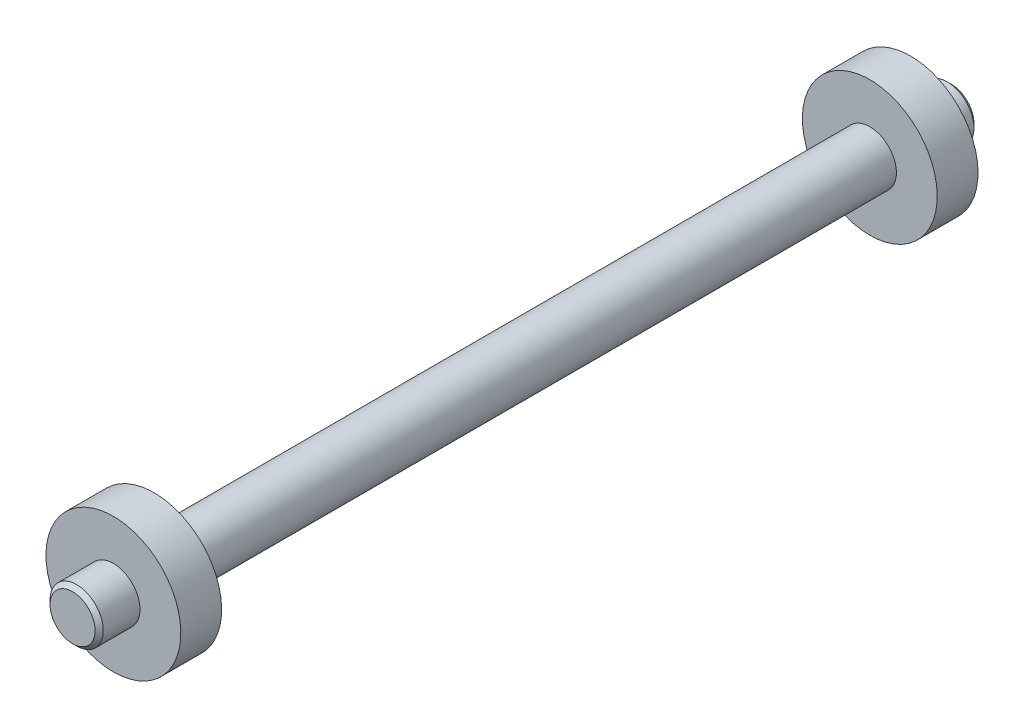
ISO-10303-21;
HEADER;
FILE_DESCRIPTION(('STEP AP214'),'2;1');
FILE_NAME('part.step','',(''),(''),'','','');
FILE_SCHEMA(('AUTOMOTIVE_DESIGN { 1 0 10303 214 1 1 1 1 }'));
ENDSEC;
DATA;
#1=APPLICATION_CONTEXT('core data for automotive mechanical design processes');
#2=APPLICATION_PROTOCOL_DEFINITION('international standard','automotive_design',2000,#1);
#3=PRODUCT_CONTEXT('',#1,'mechanical');
#4=PRODUCT('Part','Part','',(#3));
#5=PRODUCT_RELATED_PRODUCT_CATEGORY('part','',(#4));
#6=PRODUCT_DEFINITION_FORMATION('','',#4);
#7=PRODUCT_DEFINITION_CONTEXT('part definition',#1,'design');
#8=PRODUCT_DEFINITION('design','',#6,#7);
#9=PRODUCT_DEFINITION_SHAPE('','',#8);
#10=(LENGTH_UNIT() NAMED_UNIT(*) SI_UNIT(.MILLI.,.METRE.));
#11=(NAMED_UNIT(*) PLANE_ANGLE_UNIT() SI_UNIT($,.RADIAN.));
#12=(NAMED_UNIT(*) SI_UNIT($,.STERADIAN.) SOLID_ANGLE_UNIT());
#13=UNCERTAINTY_MEASURE_WITH_UNIT(LENGTH_MEASURE(1.E-05),#10,'distance_accuracy_value','');
#14=(GEOMETRIC_REPRESENTATION_CONTEXT(3) GLOBAL_UNCERTAINTY_ASSIGNED_CONTEXT((#13)) GLOBAL_UNIT_ASSIGNED_CONTEXT((#10,
#11,#12)) REPRESENTATION_CONTEXT('',''));
#15=CARTESIAN_POINT('',(0.,0.,0.));
#16=DIRECTION('',(0.,0.,1.));
#17=DIRECTION('',(1.,0.,0.));
#18=AXIS2_PLACEMENT_3D('',#15,#16,#17);
#19=CARTESIAN_POINT('',(0.,1.06,17.5));
#20=DIRECTION('',(0.,0.,-1.));
#21=DIRECTION('',(0.,1.,0.));
#22=AXIS2_PLACEMENT_3D('',#19,#20,#21);
#23=PLANE('',#22);
#24=CARTESIAN_POINT('',(0.,0.,17.5));
#25=DIRECTION('',(0.,0.,-1.));
#26=DIRECTION('',(0.,1.,0.));
#27=AXIS2_PLACEMENT_3D('',#24,#25,#26);
#28=CIRCLE('',#27,0.897500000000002);
#29=CARTESIAN_POINT('',(-0.897500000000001,0.,17.5));
#30=VERTEX_POINT('',#29);
#31=EDGE_CURVE('E35',#30,#30,#28,.F.);
#32=ORIENTED_EDGE('',*,*,#31,.T.);
#33=EDGE_LOOP('',(#32));
#34=FACE_BOUND('',#33,.T.);
#35=ADVANCED_FACE('F28',(#34),#23,.F.);
#36=CARTESIAN_POINT('',(0.,0.,17.5));
#37=DIRECTION('',(0.,0.,1.));
#38=DIRECTION('',(0.,-1.,0.));
#39=AXIS2_PLACEMENT_3D('',#36,#37,#38);
#40=CYLINDRICAL_SURFACE('',#39,1.06);
#41=CARTESIAN_POINT('',(0.,0.,17.3375));
#42=DIRECTION('',(0.,0.,-1.));
#43=DIRECTION('',(-1.,0.,0.));
#44=AXIS2_PLACEMENT_3D('',#41,#42,#43);
#45=CIRCLE('',#44,1.06);
#46=CARTESIAN_POINT('',(-1.06,0.,17.3375));
#47=VERTEX_POINT('',#46);
#48=EDGE_CURVE('E10',#47,#47,#45,.T.);
#49=ORIENTED_EDGE('',*,*,#48,.T.);
#50=EDGE_LOOP('',(#49));
#51=FACE_BOUND('',#50,.T.);
#52=CARTESIAN_POINT('',(0.,0.,15.875));
#53=DIRECTION('',(0.,0.,1.));
#54=DIRECTION('',(0.,-1.,0.));
#55=AXIS2_PLACEMENT_3D('',#52,#53,#54);
#56=CIRCLE('',#55,1.06);
#57=CARTESIAN_POINT('',(0.,-1.06,15.875));
#58=VERTEX_POINT('',#57);
#59=EDGE_CURVE('E48',#58,#58,#56,.T.);
#60=ORIENTED_EDGE('',*,*,#59,.T.);
#61=EDGE_LOOP('',(#60));
#62=FACE_BOUND('',#61,.T.);
#63=ADVANCED_FACE('F91',(#51,#62),#40,.T.);
#64=CARTESIAN_POINT('',(0.,2.685,15.875));
#65=DIRECTION('',(0.,0.,-1.));
#66=DIRECTION('',(0.,1.,0.));
#67=AXIS2_PLACEMENT_3D('',#64,#65,#66);
#68=PLANE('',#67);
#69=ORIENTED_EDGE('',*,*,#59,.F.);
#70=EDGE_LOOP('',(#69));
#71=FACE_BOUND('',#70,.T.);
#72=CARTESIAN_POINT('',(0.,0.,15.875));
#73=DIRECTION('',(0.,0.,1.));
#74=DIRECTION('',(0.,-1.,0.));
#75=AXIS2_PLACEMENT_3D('',#72,#73,#74);
#76=CIRCLE('',#75,2.685);
#77=CARTESIAN_POINT('',(0.,-2.685,15.875));
#78=VERTEX_POINT('',#77);
#79=EDGE_CURVE('E51',#78,#78,#76,.T.);
#80=ORIENTED_EDGE('',*,*,#79,.T.);
#81=EDGE_LOOP('',(#80));
#82=FACE_BOUND('',#81,.T.);
#83=ADVANCED_FACE('F96',(#71,#82),#68,.F.);
#84=CARTESIAN_POINT('',(0.,0.,17.5));
#85=DIRECTION('',(0.,0.,1.));
#86=DIRECTION('',(0.,-1.,0.));
#87=AXIS2_PLACEMENT_3D('',#84,#85,#86);
#88=CYLINDRICAL_SURFACE('',#87,2.685);
#89=ORIENTED_EDGE('',*,*,#79,.F.);
#90=EDGE_LOOP('',(#89));
#91=FACE_BOUND('',#90,.T.);
#92=CARTESIAN_POINT('',(0.,0.,14.25));
#93=DIRECTION('',(0.,0.,1.));
#94=DIRECTION('',(0.,-1.,0.));
#95=AXIS2_PLACEMENT_3D('',#92,#93,#94);
#96=CIRCLE('',#95,2.685);
#97=CARTESIAN_POINT('',(0.,-2.685,14.25));
#98=VERTEX_POINT('',#97);
#99=EDGE_CURVE('E54',#98,#98,#96,.T.);
#100=ORIENTED_EDGE('',*,*,#99,.T.);
#101=EDGE_LOOP('',(#100));
#102=FACE_BOUND('',#101,.T.);
#103=ADVANCED_FACE('F182',(#91,#102),#88,.T.);
#104=CARTESIAN_POINT('',(0.,1.06,14.25));
#105=DIRECTION('',(0.,0.,1.));
#106=DIRECTION('',(0.,-1.,0.));
#107=AXIS2_PLACEMENT_3D('',#104,#105,#106);
#108=PLANE('',#107);
#109=ORIENTED_EDGE('',*,*,#99,.F.);
#110=EDGE_LOOP('',(#109));
#111=FACE_BOUND('',#110,.T.);
#112=CARTESIAN_POINT('',(0.,0.,14.25));
#113=DIRECTION('',(0.,0.,1.));
#114=DIRECTION('',(0.,-1.,0.));
#115=AXIS2_PLACEMENT_3D('',#112,#113,#114);
#116=CIRCLE('',#115,1.06);
#117=CARTESIAN_POINT('',(0.,-1.06,14.25));
#118=VERTEX_POINT('',#117);
#119=EDGE_CURVE('E57',#118,#118,#116,.T.);
#120=ORIENTED_EDGE('',*,*,#119,.T.);
#121=EDGE_LOOP('',(#120));
#122=FACE_BOUND('',#121,.T.);
#123=ADVANCED_FACE('F172',(#111,#122),#108,.F.);
#124=CARTESIAN_POINT('',(0.,0.,17.5));
#125=DIRECTION('',(0.,0.,1.));
#126=DIRECTION('',(0.,-1.,0.));
#127=AXIS2_PLACEMENT_3D('',#124,#125,#126);
#128=CYLINDRICAL_SURFACE('',#127,1.06);
#129=ORIENTED_EDGE('',*,*,#119,.F.);
#130=EDGE_LOOP('',(#129));
#131=FACE_BOUND('',#130,.T.);
#132=CARTESIAN_POINT('',(0.,0.,-14.25));
#133=DIRECTION('',(0.,0.,1.));
#134=DIRECTION('',(0.,-1.,0.));
#135=AXIS2_PLACEMENT_3D('',#132,#133,#134);
#136=CIRCLE('',#135,1.06);
#137=CARTESIAN_POINT('',(0.,-1.06,-14.25));
#138=VERTEX_POINT('',#137);
#139=EDGE_CURVE('E60',#138,#138,#136,.T.);
#140=ORIENTED_EDGE('',*,*,#139,.T.);
#141=EDGE_LOOP('',(#140));
#142=FACE_BOUND('',#141,.T.);
#143=ADVANCED_FACE('F162',(#131,#142),#128,.T.);
#144=CARTESIAN_POINT('',(0.,2.685,-14.25));
#145=DIRECTION('',(0.,0.,-1.));
#146=DIRECTION('',(0.,1.,0.));
#147=AXIS2_PLACEMENT_3D('',#144,#145,#146);
#148=PLANE('',#147);
#149=ORIENTED_EDGE('',*,*,#139,.F.);
#150=EDGE_LOOP('',(#149));
#151=FACE_BOUND('',#150,.T.);
#152=CARTESIAN_POINT('',(0.,0.,-14.25));
#153=DIRECTION('',(0.,0.,1.));
#154=DIRECTION('',(0.,-1.,0.));
#155=AXIS2_PLACEMENT_3D('',#152,#153,#154);
#156=CIRCLE('',#155,2.685);
#157=CARTESIAN_POINT('',(0.,-2.685,-14.25));
#158=VERTEX_POINT('',#157);
#159=EDGE_CURVE('E63',#158,#158,#156,.T.);
#160=ORIENTED_EDGE('',*,*,#159,.T.);
#161=EDGE_LOOP('',(#160));
#162=FACE_BOUND('',#161,.T.);
#163=ADVANCED_FACE('F152',(#151,#162),#148,.F.);
#164=CARTESIAN_POINT('',(0.,0.,17.5));
#165=DIRECTION('',(0.,0.,1.));
#166=DIRECTION('',(0.,-1.,0.));
#167=AXIS2_PLACEMENT_3D('',#164,#165,#166);
#168=CYLINDRICAL_SURFACE('',#167,2.685);
#169=ORIENTED_EDGE('',*,*,#159,.F.);
#170=EDGE_LOOP('',(#169));
#171=FACE_BOUND('',#170,.T.);
#172=CARTESIAN_POINT('',(0.,0.,-15.875));
#173=DIRECTION('',(0.,0.,1.));
#174=DIRECTION('',(0.,-1.,0.));
#175=AXIS2_PLACEMENT_3D('',#172,#173,#174);
#176=CIRCLE('',#175,2.685);
#177=CARTESIAN_POINT('',(0.,-2.685,-15.875));
#178=VERTEX_POINT('',#177);
#179=EDGE_CURVE('E66',#178,#178,#176,.T.);
#180=ORIENTED_EDGE('',*,*,#179,.T.);
#181=EDGE_LOOP('',(#180));
#182=FACE_BOUND('',#181,.T.);
#183=ADVANCED_FACE('F87',(#171,#182),#168,.T.);
#184=CARTESIAN_POINT('',(0.,1.06,-15.875));
#185=DIRECTION('',(0.,0.,1.));
#186=DIRECTION('',(0.,-1.,0.));
#187=AXIS2_PLACEMENT_3D('',#184,#185,#186);
#188=PLANE('',#187);
#189=ORIENTED_EDGE('',*,*,#179,.F.);
#190=EDGE_LOOP('',(#189));
#191=FACE_BOUND('',#190,.T.);
#192=CARTESIAN_POINT('',(0.,0.,-15.875));
#193=DIRECTION('',(0.,0.,1.));
#194=DIRECTION('',(0.,-1.,0.));
#195=AXIS2_PLACEMENT_3D('',#192,#193,#194);
#196=CIRCLE('',#195,1.06);
#197=CARTESIAN_POINT('',(0.,-1.06,-15.875));
#198=VERTEX_POINT('',#197);
#199=EDGE_CURVE('E69',#198,#198,#196,.T.);
#200=ORIENTED_EDGE('',*,*,#199,.T.);
#201=EDGE_LOOP('',(#200));
#202=FACE_BOUND('',#201,.T.);
#203=ADVANCED_FACE('F73',(#191,#202),#188,.F.);
#204=CARTESIAN_POINT('',(0.,0.,17.5));
#205=DIRECTION('',(0.,0.,1.));
#206=DIRECTION('',(0.,-1.,0.));
#207=AXIS2_PLACEMENT_3D('',#204,#205,#206);
#208=CYLINDRICAL_SURFACE('',#207,1.06);
#209=CARTESIAN_POINT('',(0.,0.,-17.3375));
#210=DIRECTION('',(0.,0.,1.));
#211=DIRECTION('',(1.,0.,0.));
#212=AXIS2_PLACEMENT_3D('',#209,#210,#211);
#213=CIRCLE('',#212,1.06);
#214=CARTESIAN_POINT('',(1.06,0.,-17.3375));
#215=VERTEX_POINT('',#214);
#216=EDGE_CURVE('E43',#215,#215,#213,.T.);
#217=ORIENTED_EDGE('',*,*,#216,.T.);
#218=EDGE_LOOP('',(#217));
#219=FACE_BOUND('',#218,.T.);
#220=ORIENTED_EDGE('',*,*,#199,.F.);
#221=EDGE_LOOP('',(#220));
#222=FACE_BOUND('',#221,.T.);
#223=ADVANCED_FACE('F75',(#219,#222),#208,.T.);
#224=CARTESIAN_POINT('',(0.,0.,-17.5));
#225=DIRECTION('',(0.,0.,1.));
#226=DIRECTION('',(0.,-1.,0.));
#227=AXIS2_PLACEMENT_3D('',#224,#225,#226);
#228=PLANE('',#227);
#229=CARTESIAN_POINT('',(0.,0.,-17.5));
#230=DIRECTION('',(0.,0.,1.));
#231=DIRECTION('',(0.,-1.,0.));
#232=AXIS2_PLACEMENT_3D('',#229,#230,#231);
#233=CIRCLE('',#232,0.897500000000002);
#234=CARTESIAN_POINT('',(0.,-0.897500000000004,-17.5));
#235=VERTEX_POINT('',#234);
#236=EDGE_CURVE('E39',#235,#235,#233,.F.);
#237=ORIENTED_EDGE('',*,*,#236,.T.);
#238=EDGE_LOOP('',(#237));
#239=FACE_BOUND('',#238,.T.);
#240=ADVANCED_FACE('F77',(#239),#228,.F.);
#241=CARTESIAN_POINT('',(0.,0.,-17.3375));
#242=DIRECTION('',(0.,0.,1.));
#243=DIRECTION('',(1.,0.,0.));
#244=AXIS2_PLACEMENT_3D('',#241,#242,#243);
#245=CONICAL_SURFACE('',#244,1.06,0.785398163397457);
#246=ORIENTED_EDGE('',*,*,#236,.F.);
#247=EDGE_LOOP('',(#246));
#248=FACE_BOUND('',#247,.T.);
#249=ORIENTED_EDGE('',*,*,#216,.F.);
#250=EDGE_LOOP('',(#249));
#251=FACE_BOUND('',#250,.T.);
#252=ADVANCED_FACE('F84',(#248,#251),#245,.T.);
#253=CARTESIAN_POINT('',(0.,0.,17.5));
#254=DIRECTION('',(0.,0.,-1.));
#255=DIRECTION('',(-1.,0.,0.));
#256=AXIS2_PLACEMENT_3D('',#253,#254,#255);
#257=CONICAL_SURFACE('',#256,0.897500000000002,0.785398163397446);
#258=CARTESIAN_POINT('',(-1.06,0.,17.3375));
#259=CARTESIAN_POINT('',(-1.05830729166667,0.,17.3391927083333));
#260=CARTESIAN_POINT('',(-1.05661458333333,0.,17.3408854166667));
#261=CARTESIAN_POINT('',(-1.05322916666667,0.,17.3442708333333));
#262=CARTESIAN_POINT('',(-1.05153645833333,0.,17.3459635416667));
#263=CARTESIAN_POINT('',(-1.04815104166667,0.,17.3493489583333));
#264=CARTESIAN_POINT('',(-1.04645833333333,0.,17.3510416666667));
#265=CARTESIAN_POINT('',(-1.04307291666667,0.,17.3544270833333));
#266=CARTESIAN_POINT('',(-1.04138020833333,0.,17.3561197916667));
#267=CARTESIAN_POINT('',(-1.03799479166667,0.,17.3595052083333));
#268=CARTESIAN_POINT('',(-1.03630208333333,0.,17.3611979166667));
#269=CARTESIAN_POINT('',(-1.03291666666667,0.,17.3645833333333));
#270=CARTESIAN_POINT('',(-1.03122395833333,0.,17.3662760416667));
#271=CARTESIAN_POINT('',(-1.02783854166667,0.,17.3696614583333));
#272=CARTESIAN_POINT('',(-1.02614583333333,0.,17.3713541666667));
#273=CARTESIAN_POINT('',(-1.02276041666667,0.,17.3747395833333));
#274=CARTESIAN_POINT('',(-1.02106770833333,0.,17.3764322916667));
#275=CARTESIAN_POINT('',(-1.01768229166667,0.,17.3798177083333));
#276=CARTESIAN_POINT('',(-1.01598958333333,0.,17.3815104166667));
#277=CARTESIAN_POINT('',(-1.01260416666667,0.,17.3848958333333));
#278=CARTESIAN_POINT('',(-1.01091145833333,0.,17.3865885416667));
#279=CARTESIAN_POINT('',(-1.00752604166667,0.,17.3899739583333));
#280=CARTESIAN_POINT('',(-1.00583333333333,0.,17.3916666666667));
#281=CARTESIAN_POINT('',(-1.00244791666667,0.,17.3950520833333));
#282=CARTESIAN_POINT('',(-1.00075520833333,0.,17.3967447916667));
#283=CARTESIAN_POINT('',(-0.997369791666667,0.,17.4001302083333));
#284=CARTESIAN_POINT('',(-0.995677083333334,0.,17.4018229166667));
#285=CARTESIAN_POINT('',(-0.992291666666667,0.,17.4052083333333));
#286=CARTESIAN_POINT('',(-0.990598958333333,0.,17.4069010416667));
#287=CARTESIAN_POINT('',(-0.987213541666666,0.,17.4102864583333));
#288=CARTESIAN_POINT('',(-0.985520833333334,0.,17.4119791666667));
#289=CARTESIAN_POINT('',(-0.982135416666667,0.,17.4153645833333));
#290=CARTESIAN_POINT('',(-0.980442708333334,0.,17.4170572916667));
#291=CARTESIAN_POINT('',(-0.977057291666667,0.,17.4204427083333));
#292=CARTESIAN_POINT('',(-0.975364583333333,0.,17.4221354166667));
#293=CARTESIAN_POINT('',(-0.971979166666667,0.,17.4255208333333));
#294=CARTESIAN_POINT('',(-0.970286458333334,0.,17.4272135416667));
#295=CARTESIAN_POINT('',(-0.966901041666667,0.,17.4305989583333));
#296=CARTESIAN_POINT('',(-0.965208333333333,0.,17.4322916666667));
#297=CARTESIAN_POINT('',(-0.961822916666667,0.,17.4356770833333));
#298=CARTESIAN_POINT('',(-0.960130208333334,0.,17.4373697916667));
#299=CARTESIAN_POINT('',(-0.956744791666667,0.,17.4407552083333));
#300=CARTESIAN_POINT('',(-0.955052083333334,0.,17.4424479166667));
#301=CARTESIAN_POINT('',(-0.951666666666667,0.,17.4458333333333));
#302=CARTESIAN_POINT('',(-0.949973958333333,0.,17.4475260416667));
#303=CARTESIAN_POINT('',(-0.946588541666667,0.,17.4509114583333));
#304=CARTESIAN_POINT('',(-0.944895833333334,0.,17.4526041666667));
#305=CARTESIAN_POINT('',(-0.941510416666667,0.,17.4559895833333));
#306=CARTESIAN_POINT('',(-0.939817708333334,0.,17.4576822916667));
#307=CARTESIAN_POINT('',(-0.936432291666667,0.,17.4610677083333));
#308=CARTESIAN_POINT('',(-0.934739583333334,0.,17.4627604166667));
#309=CARTESIAN_POINT('',(-0.931354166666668,0.,17.4661458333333));
#310=CARTESIAN_POINT('',(-0.929661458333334,0.,17.4678385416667));
#311=CARTESIAN_POINT('',(-0.926276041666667,0.,17.4712239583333));
#312=CARTESIAN_POINT('',(-0.924583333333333,0.,17.4729166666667));
#313=CARTESIAN_POINT('',(-0.921197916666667,0.,17.4763020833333));
#314=CARTESIAN_POINT('',(-0.919505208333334,0.,17.4779947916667));
#315=CARTESIAN_POINT('',(-0.916119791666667,0.,17.4813802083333));
#316=CARTESIAN_POINT('',(-0.914427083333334,0.,17.4830729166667));
#317=CARTESIAN_POINT('',(-0.911041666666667,0.,17.4864583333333));
#318=CARTESIAN_POINT('',(-0.909348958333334,0.,17.4881510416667));
#319=CARTESIAN_POINT('',(-0.905963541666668,0.,17.4915364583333));
#320=CARTESIAN_POINT('',(-0.904270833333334,0.,17.4932291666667));
#321=CARTESIAN_POINT('',(-0.900885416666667,0.,17.4966145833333));
#322=CARTESIAN_POINT('',(-0.899192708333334,0.,17.4983072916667));
#323=CARTESIAN_POINT('',(-0.897500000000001,0.,17.5));
#324=B_SPLINE_CURVE_WITH_KNOTS('',3,(#258,#259,#260,#261,#262,#263,#264,#265,#266,#267,#268,
#269,#270,#271,#272,#273,#274,#275,#276,#277,#278,#279,#280,#281,#282,#283,#284,#285,#286,#287,
#288,#289,#290,#291,#292,#293,#294,#295,#296,#297,#298,#299,#300,#301,#302,#303,#304,#305,#306,
#307,#308,#309,#310,#311,#312,#313,#314,#315,#316,#317,#318,#319,#320,#321,#322,#323),
.UNSPECIFIED.,.F.,.F.,(4,2,2,2,2,2,2,2,2,2,2,2,2,2,2,2,2,2,2,2,2,2,2,2,2,2,2,2,2,2,2,2,4),(0.,
0.00718155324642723,0.0143631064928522,0.0215446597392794,0.0287262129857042,0.0359077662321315,
0.0430893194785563,0.0502708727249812,0.0574524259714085,0.0646339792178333,0.0718155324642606,
0.0789970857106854,0.0861786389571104,0.0933601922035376,0.100541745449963,0.10772329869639,
0.114904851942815,0.122086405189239,0.129267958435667,0.136449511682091,0.143631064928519,
0.150812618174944,0.157994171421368,0.165175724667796,0.172357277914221,0.179538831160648,
0.186720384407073,0.193901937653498,0.201083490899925,0.20826504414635,0.215446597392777,
0.222628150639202,0.229809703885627),.UNSPECIFIED.);
#325=EDGE_CURVE('BSEAM30',#47,#30,#324,.T.);
#326=ORIENTED_EDGE('',*,*,#48,.F.);
#327=ORIENTED_EDGE('',*,*,#31,.F.);
#328=ORIENTED_EDGE('',*,*,#325,.T.);
#329=ORIENTED_EDGE('',*,*,#325,.F.);
#330=EDGE_LOOP('',(#326,#328,#327,#329));
#331=FACE_BOUND('',#330,.T.);
#332=ADVANCED_FACE('F30',(#331),#257,.T.);
#333=CLOSED_SHELL('',(#35,#63,#83,#103,#123,#143,#163,#183,#203,#223,#240,#252,#332));
#334=MANIFOLD_SOLID_BREP('B2',#333);
#335=ADVANCED_BREP_SHAPE_REPRESENTATION('',(#18,#334),#14);
#336=SHAPE_DEFINITION_REPRESENTATION(#9,#335);
ENDSEC;
END-ISO-10303-21;
